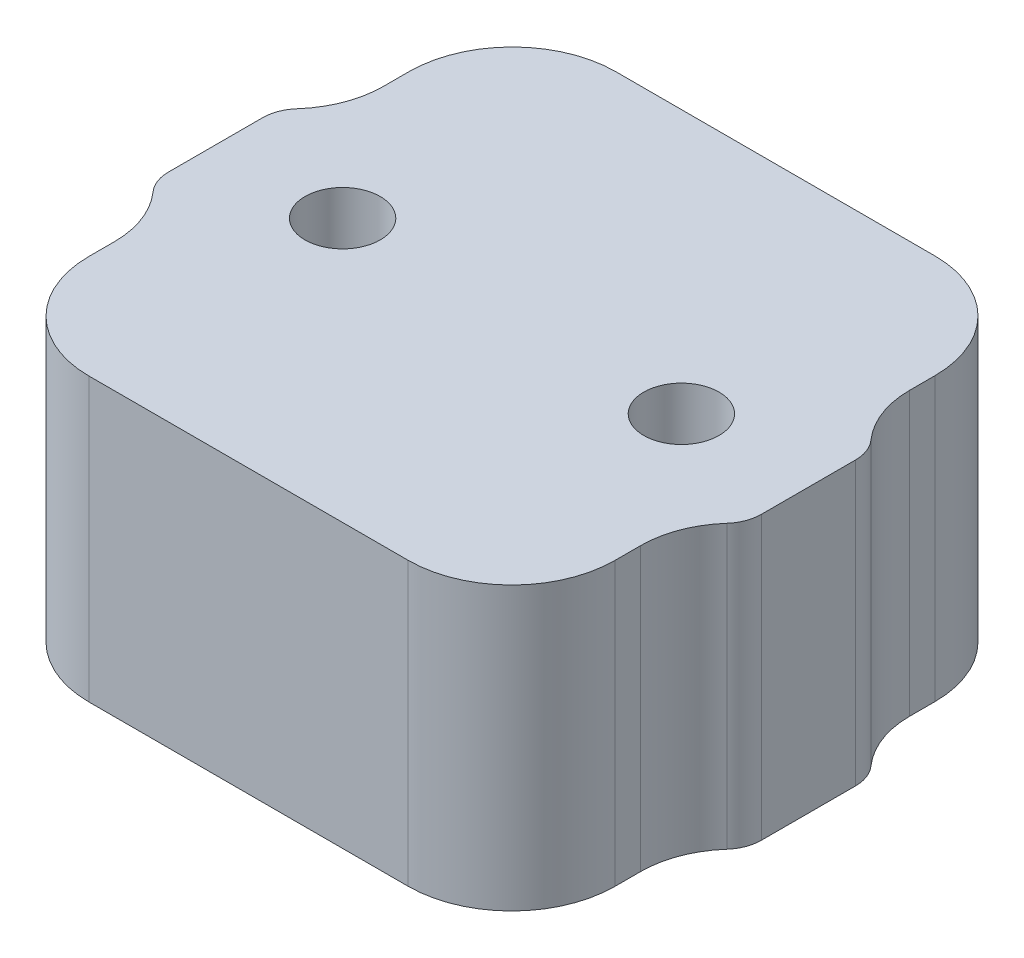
ISO-10303-21;
HEADER;
FILE_DESCRIPTION(('STEP AP214'),'2;1');
FILE_NAME('part.step','',(''),(''),'','','');
FILE_SCHEMA(('AUTOMOTIVE_DESIGN { 1 0 10303 214 1 1 1 1 }'));
ENDSEC;
DATA;
#1=APPLICATION_CONTEXT('core data for automotive mechanical design processes');
#2=APPLICATION_PROTOCOL_DEFINITION('international standard','automotive_design',2000,#1);
#3=PRODUCT_CONTEXT('',#1,'mechanical');
#4=PRODUCT('Part','Part','',(#3));
#5=PRODUCT_RELATED_PRODUCT_CATEGORY('part','',(#4));
#6=PRODUCT_DEFINITION_FORMATION('','',#4);
#7=PRODUCT_DEFINITION_CONTEXT('part definition',#1,'design');
#8=PRODUCT_DEFINITION('design','',#6,#7);
#9=PRODUCT_DEFINITION_SHAPE('','',#8);
#10=(LENGTH_UNIT() NAMED_UNIT(*) SI_UNIT(.MILLI.,.METRE.));
#11=(NAMED_UNIT(*) PLANE_ANGLE_UNIT() SI_UNIT($,.RADIAN.));
#12=(NAMED_UNIT(*) SI_UNIT($,.STERADIAN.) SOLID_ANGLE_UNIT());
#13=UNCERTAINTY_MEASURE_WITH_UNIT(LENGTH_MEASURE(1.E-05),#10,'distance_accuracy_value','');
#14=(GEOMETRIC_REPRESENTATION_CONTEXT(3) GLOBAL_UNCERTAINTY_ASSIGNED_CONTEXT((#13)) GLOBAL_UNIT_ASSIGNED_CONTEXT((#10,
#11,#12)) REPRESENTATION_CONTEXT('',''));
#15=CARTESIAN_POINT('',(0.,0.,0.));
#16=DIRECTION('',(0.,0.,1.));
#17=DIRECTION('',(1.,0.,0.));
#18=AXIS2_PLACEMENT_3D('',#15,#16,#17);
#19=CARTESIAN_POINT('',(-41.7259877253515,3.,-14.52639048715));
#20=DIRECTION('',(0.,-1.,0.));
#21=DIRECTION('',(0.,0.,-1.));
#22=AXIS2_PLACEMENT_3D('',#19,#20,#21);
#23=CYLINDRICAL_SURFACE('',#22,0.400000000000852);
#24=CARTESIAN_POINT('',(-41.7259877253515,0.,-14.52639048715));
#25=DIRECTION('',(0.,1.,0.));
#26=DIRECTION('',(0.,0.,1.));
#27=AXIS2_PLACEMENT_3D('',#24,#25,#26);
#28=CIRCLE('',#27,0.400000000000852);
#29=CARTESIAN_POINT('',(-42.0249214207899,0.,-14.7921698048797));
#30=VERTEX_POINT('',#29);
#31=CARTESIAN_POINT('',(-42.1259877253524,0.,-14.52639048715));
#32=VERTEX_POINT('',#31);
#33=EDGE_CURVE('E204',#30,#32,#28,.T.);
#34=ORIENTED_EDGE('',*,*,#33,.T.);
#35=DIRECTION('',(0.,-1.,0.));
#36=VECTOR('',#35,1.);
#37=CARTESIAN_POINT('',(-42.1259877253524,3.,-14.52639048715));
#38=LINE('',#37,#36);
#39=CARTESIAN_POINT('',(-42.1259877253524,3.,-14.52639048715));
#40=VERTEX_POINT('',#39);
#41=EDGE_CURVE('E11',#40,#32,#38,.T.);
#42=ORIENTED_EDGE('',*,*,#41,.F.);
#43=CARTESIAN_POINT('',(-41.7259877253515,3.,-14.52639048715));
#44=DIRECTION('',(0.,1.,0.));
#45=DIRECTION('',(0.,0.,1.));
#46=AXIS2_PLACEMENT_3D('',#43,#44,#45);
#47=CIRCLE('',#46,0.400000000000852);
#48=CARTESIAN_POINT('',(-42.0249214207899,3.,-14.7921698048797));
#49=VERTEX_POINT('',#48);
#50=EDGE_CURVE('E243',#49,#40,#47,.T.);
#51=ORIENTED_EDGE('',*,*,#50,.F.);
#52=DIRECTION('',(0.,-1.,0.));
#53=VECTOR('',#52,1.);
#54=CARTESIAN_POINT('',(-42.0249214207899,3.,-14.7921698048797));
#55=LINE('',#54,#53);
#56=EDGE_CURVE('E200',#49,#30,#55,.T.);
#57=ORIENTED_EDGE('',*,*,#56,.T.);
#58=EDGE_LOOP('',(#34,#42,#51,#57));
#59=FACE_BOUND('',#58,.T.);
#60=ADVANCED_FACE('F36',(#59),#23,.T.);
#61=CARTESIAN_POINT('',(-42.1259877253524,3.,-14.52639048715));
#62=DIRECTION('',(1.,0.,0.));
#63=DIRECTION('',(0.,0.,-1.));
#64=AXIS2_PLACEMENT_3D('',#61,#62,#63);
#65=PLANE('',#64);
#66=DIRECTION('',(0.,0.,1.));
#67=VECTOR('',#66,1.);
#68=CARTESIAN_POINT('',(-42.1259877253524,0.,-14.52639048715));
#69=LINE('',#68,#67);
#70=CARTESIAN_POINT('',(-42.1259877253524,0.,-13.52639048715));
#71=VERTEX_POINT('',#70);
#72=EDGE_CURVE('E207',#32,#71,#69,.T.);
#73=ORIENTED_EDGE('',*,*,#72,.T.);
#74=DIRECTION('',(0.,-1.,0.));
#75=VECTOR('',#74,1.);
#76=CARTESIAN_POINT('',(-42.1259877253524,3.,-13.52639048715));
#77=LINE('',#76,#75);
#78=CARTESIAN_POINT('',(-42.1259877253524,3.,-13.52639048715));
#79=VERTEX_POINT('',#78);
#80=EDGE_CURVE('E44',#79,#71,#77,.T.);
#81=ORIENTED_EDGE('',*,*,#80,.F.);
#82=DIRECTION('',(0.,0.,1.));
#83=VECTOR('',#82,1.);
#84=CARTESIAN_POINT('',(-42.1259877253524,3.,-14.52639048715));
#85=LINE('',#84,#83);
#86=EDGE_CURVE('E131',#40,#79,#85,.T.);
#87=ORIENTED_EDGE('',*,*,#86,.F.);
#88=ORIENTED_EDGE('',*,*,#41,.T.);
#89=EDGE_LOOP('',(#73,#81,#87,#88));
#90=FACE_BOUND('',#89,.T.);
#91=ADVANCED_FACE('F362',(#90),#65,.F.);
#92=CARTESIAN_POINT('',(-41.7259877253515,3.,-13.52639048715));
#93=DIRECTION('',(0.,-1.,0.));
#94=DIRECTION('',(0.,0.,-1.));
#95=AXIS2_PLACEMENT_3D('',#92,#93,#94);
#96=CYLINDRICAL_SURFACE('',#95,0.400000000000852);
#97=CARTESIAN_POINT('',(-41.7259877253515,0.,-13.52639048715));
#98=DIRECTION('',(0.,1.,0.));
#99=DIRECTION('',(0.,0.,-1.));
#100=AXIS2_PLACEMENT_3D('',#97,#98,#99);
#101=CIRCLE('',#100,0.400000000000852);
#102=CARTESIAN_POINT('',(-42.0249214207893,0.,-13.2606111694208));
#103=VERTEX_POINT('',#102);
#104=EDGE_CURVE('E210',#71,#103,#101,.T.);
#105=ORIENTED_EDGE('',*,*,#104,.T.);
#106=DIRECTION('',(0.,-1.,0.));
#107=VECTOR('',#106,1.);
#108=CARTESIAN_POINT('',(-42.0249214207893,3.,-13.2606111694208));
#109=LINE('',#108,#107);
#110=CARTESIAN_POINT('',(-42.0249214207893,3.,-13.2606111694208));
#111=VERTEX_POINT('',#110);
#112=EDGE_CURVE('E286',#111,#103,#109,.T.);
#113=ORIENTED_EDGE('',*,*,#112,.F.);
#114=CARTESIAN_POINT('',(-41.7259877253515,3.,-13.52639048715));
#115=DIRECTION('',(0.,1.,0.));
#116=DIRECTION('',(0.,0.,-1.));
#117=AXIS2_PLACEMENT_3D('',#114,#115,#116);
#118=CIRCLE('',#117,0.400000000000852);
#119=EDGE_CURVE('E294',#79,#111,#118,.T.);
#120=ORIENTED_EDGE('',*,*,#119,.F.);
#121=ORIENTED_EDGE('',*,*,#80,.T.);
#122=EDGE_LOOP('',(#105,#113,#120,#121));
#123=FACE_BOUND('',#122,.T.);
#124=ADVANCED_FACE('F292',(#123),#96,.T.);
#125=CARTESIAN_POINT('',(-42.7722556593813,3.,-12.5961628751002));
#126=DIRECTION('',(0.,-1.,0.));
#127=DIRECTION('',(0.,0.,-1.));
#128=AXIS2_PLACEMENT_3D('',#125,#126,#127);
#129=CYLINDRICAL_SURFACE('',#128,0.999999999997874);
#130=CARTESIAN_POINT('',(-42.7722556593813,0.,-12.5961628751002));
#131=DIRECTION('',(0.,-1.,0.));
#132=DIRECTION('',(0.,0.,1.));
#133=AXIS2_PLACEMENT_3D('',#130,#131,#132);
#134=CIRCLE('',#133,0.999999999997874);
#135=CARTESIAN_POINT('',(-41.7722556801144,0.,-12.5963664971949));
#136=VERTEX_POINT('',#135);
#137=EDGE_CURVE('E212',#103,#136,#134,.T.);
#138=ORIENTED_EDGE('',*,*,#137,.T.);
#139=DIRECTION('',(0.,-1.,0.));
#140=VECTOR('',#139,1.);
#141=CARTESIAN_POINT('',(-41.7722556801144,3.,-12.5963664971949));
#142=LINE('',#141,#140);
#143=CARTESIAN_POINT('',(-41.7722556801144,3.,-12.5963664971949));
#144=VERTEX_POINT('',#143);
#145=EDGE_CURVE('E283',#144,#136,#142,.T.);
#146=ORIENTED_EDGE('',*,*,#145,.F.);
#147=CARTESIAN_POINT('',(-42.7722556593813,3.,-12.5961628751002));
#148=DIRECTION('',(0.,-1.,0.));
#149=DIRECTION('',(0.,0.,1.));
#150=AXIS2_PLACEMENT_3D('',#147,#148,#149);
#151=CIRCLE('',#150,0.999999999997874);
#152=EDGE_CURVE('E312',#111,#144,#151,.T.);
#153=ORIENTED_EDGE('',*,*,#152,.F.);
#154=ORIENTED_EDGE('',*,*,#112,.T.);
#155=EDGE_LOOP('',(#138,#146,#153,#154));
#156=FACE_BOUND('',#155,.T.);
#157=ADVANCED_FACE('F303',(#156),#129,.F.);
#158=CARTESIAN_POINT('',(-41.7722006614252,3.,-12.326166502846));
#159=DIRECTION('',(0.999999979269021,0.,-0.000203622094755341));
#160=DIRECTION('',(-0.000203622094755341,0.,-0.999999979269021));
#161=AXIS2_PLACEMENT_3D('',#158,#159,#160);
#162=PLANE('',#161);
#163=DIRECTION('',(0.000203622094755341,0.,0.999999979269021));
#164=VECTOR('',#163,1.);
#165=CARTESIAN_POINT('',(-41.7722006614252,0.,-12.326166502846));
#166=LINE('',#165,#164);
#167=CARTESIAN_POINT('',(-41.7722006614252,0.,-12.326166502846));
#168=VERTEX_POINT('',#167);
#169=EDGE_CURVE('E214',#136,#168,#166,.T.);
#170=ORIENTED_EDGE('',*,*,#169,.T.);
#171=DIRECTION('',(0.,-1.,0.));
#172=VECTOR('',#171,1.);
#173=CARTESIAN_POINT('',(-41.7722006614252,3.,-12.326166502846));
#174=LINE('',#173,#172);
#175=CARTESIAN_POINT('',(-41.7722006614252,3.,-12.326166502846));
#176=VERTEX_POINT('',#175);
#177=EDGE_CURVE('E280',#176,#168,#174,.T.);
#178=ORIENTED_EDGE('',*,*,#177,.F.);
#179=DIRECTION('',(0.000203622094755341,0.,0.999999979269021));
#180=VECTOR('',#179,1.);
#181=CARTESIAN_POINT('',(-41.7722006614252,3.,-12.326166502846));
#182=LINE('',#181,#180);
#183=EDGE_CURVE('E309',#144,#176,#182,.T.);
#184=ORIENTED_EDGE('',*,*,#183,.F.);
#185=ORIENTED_EDGE('',*,*,#145,.T.);
#186=EDGE_LOOP('',(#170,#178,#184,#185));
#187=FACE_BOUND('',#186,.T.);
#188=ADVANCED_FACE('F307',(#187),#162,.F.);
#189=CARTESIAN_POINT('',(-40.6722006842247,3.,-12.3263904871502));
#190=DIRECTION('',(0.,-1.,0.));
#191=DIRECTION('',(0.,0.,-1.));
#192=AXIS2_PLACEMENT_3D('',#189,#190,#191);
#193=CYLINDRICAL_SURFACE('',#192,1.10000000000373);
#194=CARTESIAN_POINT('',(-40.6722006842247,0.,-12.3263904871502));
#195=DIRECTION('',(0.,1.,0.));
#196=DIRECTION('',(0.,0.,-1.));
#197=AXIS2_PLACEMENT_3D('',#194,#195,#196);
#198=CIRCLE('',#197,1.10000000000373);
#199=CARTESIAN_POINT('',(-40.6722006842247,0.,-11.2263904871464));
#200=VERTEX_POINT('',#199);
#201=EDGE_CURVE('E216',#168,#200,#198,.T.);
#202=ORIENTED_EDGE('',*,*,#201,.T.);
#203=DIRECTION('',(0.,-1.,0.));
#204=VECTOR('',#203,1.);
#205=CARTESIAN_POINT('',(-40.6722006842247,3.,-11.2263904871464));
#206=LINE('',#205,#204);
#207=CARTESIAN_POINT('',(-40.6722006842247,3.,-11.2263904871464));
#208=VERTEX_POINT('',#207);
#209=EDGE_CURVE('E277',#208,#200,#206,.T.);
#210=ORIENTED_EDGE('',*,*,#209,.F.);
#211=CARTESIAN_POINT('',(-40.6722006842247,3.,-12.3263904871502));
#212=DIRECTION('',(0.,1.,0.));
#213=DIRECTION('',(0.,0.,-1.));
#214=AXIS2_PLACEMENT_3D('',#211,#212,#213);
#215=CIRCLE('',#214,1.10000000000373);
#216=EDGE_CURVE('E311',#176,#208,#215,.T.);
#217=ORIENTED_EDGE('',*,*,#216,.F.);
#218=ORIENTED_EDGE('',*,*,#177,.T.);
#219=EDGE_LOOP('',(#202,#210,#217,#218));
#220=FACE_BOUND('',#219,.T.);
#221=ADVANCED_FACE('F375',(#220),#193,.T.);
#222=CARTESIAN_POINT('',(-37.2797747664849,3.,-11.2263904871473));
#223=DIRECTION('',(0.,0.,-1.));
#224=DIRECTION('',(-1.,0.,0.));
#225=AXIS2_PLACEMENT_3D('',#222,#223,#224);
#226=PLANE('',#225);
#227=DIRECTION('',(1.,0.,0.));
#228=VECTOR('',#227,1.);
#229=CARTESIAN_POINT('',(-37.2797747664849,0.,-11.2263904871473));
#230=LINE('',#229,#228);
#231=CARTESIAN_POINT('',(-37.2797747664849,0.,-11.2263904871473));
#232=VERTEX_POINT('',#231);
#233=EDGE_CURVE('E218',#200,#232,#230,.T.);
#234=ORIENTED_EDGE('',*,*,#233,.T.);
#235=DIRECTION('',(0.,-1.,0.));
#236=VECTOR('',#235,1.);
#237=CARTESIAN_POINT('',(-37.2797747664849,3.,-11.2263904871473));
#238=LINE('',#237,#236);
#239=CARTESIAN_POINT('',(-37.2797747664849,3.,-11.2263904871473));
#240=VERTEX_POINT('',#239);
#241=EDGE_CURVE('E274',#240,#232,#238,.T.);
#242=ORIENTED_EDGE('',*,*,#241,.F.);
#243=DIRECTION('',(1.,0.,0.));
#244=VECTOR('',#243,1.);
#245=CARTESIAN_POINT('',(-37.2797747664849,3.,-11.2263904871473));
#246=LINE('',#245,#244);
#247=EDGE_CURVE('E314',#208,#240,#246,.T.);
#248=ORIENTED_EDGE('',*,*,#247,.F.);
#249=ORIENTED_EDGE('',*,*,#209,.T.);
#250=EDGE_LOOP('',(#234,#242,#248,#249));
#251=FACE_BOUND('',#250,.T.);
#252=ADVANCED_FACE('F378',(#251),#226,.F.);
#253=CARTESIAN_POINT('',(-37.2797747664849,3.,-12.3263904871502));
#254=DIRECTION('',(0.,-1.,0.));
#255=DIRECTION('',(0.,0.,-1.));
#256=AXIS2_PLACEMENT_3D('',#253,#254,#255);
#257=CYLINDRICAL_SURFACE('',#256,1.10000000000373);
#258=CARTESIAN_POINT('',(-37.2797747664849,0.,-12.3263904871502));
#259=DIRECTION('',(0.,1.,0.));
#260=DIRECTION('',(0.,0.,1.));
#261=AXIS2_PLACEMENT_3D('',#258,#259,#260);
#262=CIRCLE('',#261,1.10000000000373);
#263=CARTESIAN_POINT('',(-36.1797747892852,0.,-12.326166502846));
#264=VERTEX_POINT('',#263);
#265=EDGE_CURVE('E220',#232,#264,#262,.T.);
#266=ORIENTED_EDGE('',*,*,#265,.T.);
#267=DIRECTION('',(0.,-1.,0.));
#268=VECTOR('',#267,1.);
#269=CARTESIAN_POINT('',(-36.1797747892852,3.,-12.326166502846));
#270=LINE('',#269,#268);
#271=CARTESIAN_POINT('',(-36.1797747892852,3.,-12.326166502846));
#272=VERTEX_POINT('',#271);
#273=EDGE_CURVE('E271',#272,#264,#270,.T.);
#274=ORIENTED_EDGE('',*,*,#273,.F.);
#275=CARTESIAN_POINT('',(-37.2797747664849,3.,-12.3263904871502));
#276=DIRECTION('',(0.,1.,0.));
#277=DIRECTION('',(0.,0.,1.));
#278=AXIS2_PLACEMENT_3D('',#275,#276,#277);
#279=CIRCLE('',#278,1.10000000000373);
#280=EDGE_CURVE('E320',#240,#272,#279,.T.);
#281=ORIENTED_EDGE('',*,*,#280,.F.);
#282=ORIENTED_EDGE('',*,*,#241,.T.);
#283=EDGE_LOOP('',(#266,#274,#281,#282));
#284=FACE_BOUND('',#283,.T.);
#285=ADVANCED_FACE('F382',(#284),#257,.T.);
#286=CARTESIAN_POINT('',(-36.1797747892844,3.,-12.326166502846));
#287=DIRECTION('',(-0.999999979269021,0.,-0.000203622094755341));
#288=DIRECTION('',(-0.000203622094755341,0.,0.999999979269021));
#289=AXIS2_PLACEMENT_3D('',#286,#287,#288);
#290=PLANE('',#289);
#291=DIRECTION('',(0.000203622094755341,0.,-0.999999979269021));
#292=VECTOR('',#291,1.);
#293=CARTESIAN_POINT('',(-36.1797747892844,0.,-12.326166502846));
#294=LINE('',#293,#292);
#295=CARTESIAN_POINT('',(-36.1797197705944,0.,-12.5963664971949));
#296=VERTEX_POINT('',#295);
#297=EDGE_CURVE('E222',#264,#296,#294,.T.);
#298=ORIENTED_EDGE('',*,*,#297,.T.);
#299=DIRECTION('',(0.,-1.,0.));
#300=VECTOR('',#299,1.);
#301=CARTESIAN_POINT('',(-36.1797197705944,3.,-12.5963664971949));
#302=LINE('',#301,#300);
#303=CARTESIAN_POINT('',(-36.1797197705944,3.,-12.5963664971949));
#304=VERTEX_POINT('',#303);
#305=EDGE_CURVE('E268',#304,#296,#302,.T.);
#306=ORIENTED_EDGE('',*,*,#305,.F.);
#307=DIRECTION('',(0.000203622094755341,0.,-0.999999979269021));
#308=VECTOR('',#307,1.);
#309=CARTESIAN_POINT('',(-36.1797747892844,3.,-12.326166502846));
#310=LINE('',#309,#308);
#311=EDGE_CURVE('E322',#272,#304,#310,.T.);
#312=ORIENTED_EDGE('',*,*,#311,.F.);
#313=ORIENTED_EDGE('',*,*,#273,.T.);
#314=EDGE_LOOP('',(#298,#306,#312,#313));
#315=FACE_BOUND('',#314,.T.);
#316=ADVANCED_FACE('F386',(#315),#290,.F.);
#317=CARTESIAN_POINT('',(-35.1797197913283,3.,-12.5961628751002));
#318=DIRECTION('',(0.,-1.,0.));
#319=DIRECTION('',(0.,0.,-1.));
#320=AXIS2_PLACEMENT_3D('',#317,#318,#319);
#321=CYLINDRICAL_SURFACE('',#320,0.999999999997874);
#322=CARTESIAN_POINT('',(-35.1797197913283,0.,-12.5961628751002));
#323=DIRECTION('',(0.,-1.,0.));
#324=DIRECTION('',(0.,0.,-1.));
#325=AXIS2_PLACEMENT_3D('',#322,#323,#324);
#326=CIRCLE('',#325,0.999999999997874);
#327=CARTESIAN_POINT('',(-35.9270540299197,0.,-13.2606111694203));
#328=VERTEX_POINT('',#327);
#329=EDGE_CURVE('E224',#296,#328,#326,.T.);
#330=ORIENTED_EDGE('',*,*,#329,.T.);
#331=DIRECTION('',(0.,-1.,0.));
#332=VECTOR('',#331,1.);
#333=CARTESIAN_POINT('',(-35.9270540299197,3.,-13.2606111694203));
#334=LINE('',#333,#332);
#335=CARTESIAN_POINT('',(-35.9270540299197,3.,-13.2606111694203));
#336=VERTEX_POINT('',#335);
#337=EDGE_CURVE('E265',#336,#328,#334,.T.);
#338=ORIENTED_EDGE('',*,*,#337,.F.);
#339=CARTESIAN_POINT('',(-35.1797197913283,3.,-12.5961628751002));
#340=DIRECTION('',(0.,-1.,0.));
#341=DIRECTION('',(0.,0.,-1.));
#342=AXIS2_PLACEMENT_3D('',#339,#340,#341);
#343=CIRCLE('',#342,0.999999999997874);
#344=EDGE_CURVE('E324',#304,#336,#343,.T.);
#345=ORIENTED_EDGE('',*,*,#344,.F.);
#346=ORIENTED_EDGE('',*,*,#305,.T.);
#347=EDGE_LOOP('',(#330,#338,#345,#346));
#348=FACE_BOUND('',#347,.T.);
#349=ADVANCED_FACE('F390',(#348),#321,.F.);
#350=CARTESIAN_POINT('',(-36.2259877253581,3.,-13.52639048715));
#351=DIRECTION('',(0.,-1.,0.));
#352=DIRECTION('',(0.,0.,-1.));
#353=AXIS2_PLACEMENT_3D('',#350,#351,#352);
#354=CYLINDRICAL_SURFACE('',#353,0.400000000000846);
#355=CARTESIAN_POINT('',(-36.2259877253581,0.,-13.52639048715));
#356=DIRECTION('',(0.,1.,0.));
#357=DIRECTION('',(0.,0.,1.));
#358=AXIS2_PLACEMENT_3D('',#355,#356,#357);
#359=CIRCLE('',#358,0.400000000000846);
#360=CARTESIAN_POINT('',(-35.8259877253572,0.,-13.52639048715));
#361=VERTEX_POINT('',#360);
#362=EDGE_CURVE('E226',#328,#361,#359,.T.);
#363=ORIENTED_EDGE('',*,*,#362,.T.);
#364=DIRECTION('',(0.,-1.,0.));
#365=VECTOR('',#364,1.);
#366=CARTESIAN_POINT('',(-35.8259877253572,3.,-13.52639048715));
#367=LINE('',#366,#365);
#368=CARTESIAN_POINT('',(-35.8259877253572,3.,-13.52639048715));
#369=VERTEX_POINT('',#368);
#370=EDGE_CURVE('E262',#369,#361,#367,.T.);
#371=ORIENTED_EDGE('',*,*,#370,.F.);
#372=CARTESIAN_POINT('',(-36.2259877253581,3.,-13.52639048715));
#373=DIRECTION('',(0.,1.,0.));
#374=DIRECTION('',(0.,0.,1.));
#375=AXIS2_PLACEMENT_3D('',#372,#373,#374);
#376=CIRCLE('',#375,0.400000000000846);
#377=EDGE_CURVE('E326',#336,#369,#376,.T.);
#378=ORIENTED_EDGE('',*,*,#377,.F.);
#379=ORIENTED_EDGE('',*,*,#337,.T.);
#380=EDGE_LOOP('',(#363,#371,#378,#379));
#381=FACE_BOUND('',#380,.T.);
#382=ADVANCED_FACE('F394',(#381),#354,.T.);
#383=CARTESIAN_POINT('',(-35.8259877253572,3.,-14.52639048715));
#384=DIRECTION('',(-1.,0.,0.));
#385=DIRECTION('',(0.,0.,1.));
#386=AXIS2_PLACEMENT_3D('',#383,#384,#385);
#387=PLANE('',#386);
#388=DIRECTION('',(0.,0.,-1.));
#389=VECTOR('',#388,1.);
#390=CARTESIAN_POINT('',(-35.8259877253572,0.,-14.52639048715));
#391=LINE('',#390,#389);
#392=CARTESIAN_POINT('',(-35.8259877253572,0.,-14.52639048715));
#393=VERTEX_POINT('',#392);
#394=EDGE_CURVE('E228',#361,#393,#391,.T.);
#395=ORIENTED_EDGE('',*,*,#394,.T.);
#396=DIRECTION('',(0.,-1.,0.));
#397=VECTOR('',#396,1.);
#398=CARTESIAN_POINT('',(-35.8259877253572,3.,-14.52639048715));
#399=LINE('',#398,#397);
#400=CARTESIAN_POINT('',(-35.8259877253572,3.,-14.52639048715));
#401=VERTEX_POINT('',#400);
#402=EDGE_CURVE('E259',#401,#393,#399,.T.);
#403=ORIENTED_EDGE('',*,*,#402,.F.);
#404=DIRECTION('',(0.,0.,-1.));
#405=VECTOR('',#404,1.);
#406=CARTESIAN_POINT('',(-35.8259877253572,3.,-14.52639048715));
#407=LINE('',#406,#405);
#408=EDGE_CURVE('E328',#369,#401,#407,.T.);
#409=ORIENTED_EDGE('',*,*,#408,.F.);
#410=ORIENTED_EDGE('',*,*,#370,.T.);
#411=EDGE_LOOP('',(#395,#403,#409,#410));
#412=FACE_BOUND('',#411,.T.);
#413=ADVANCED_FACE('F398',(#412),#387,.F.);
#414=CARTESIAN_POINT('',(-36.2259877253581,3.,-14.52639048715));
#415=DIRECTION('',(0.,-1.,0.));
#416=DIRECTION('',(0.,0.,-1.));
#417=AXIS2_PLACEMENT_3D('',#414,#415,#416);
#418=CYLINDRICAL_SURFACE('',#417,0.400000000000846);
#419=CARTESIAN_POINT('',(-36.2259877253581,0.,-14.52639048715));
#420=DIRECTION('',(0.,1.,0.));
#421=DIRECTION('',(0.,0.,-1.));
#422=AXIS2_PLACEMENT_3D('',#419,#420,#421);
#423=CIRCLE('',#422,0.400000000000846);
#424=CARTESIAN_POINT('',(-35.9270540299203,0.,-14.7921698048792));
#425=VERTEX_POINT('',#424);
#426=EDGE_CURVE('E230',#393,#425,#423,.T.);
#427=ORIENTED_EDGE('',*,*,#426,.T.);
#428=DIRECTION('',(0.,-1.,0.));
#429=VECTOR('',#428,1.);
#430=CARTESIAN_POINT('',(-35.9270540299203,3.,-14.7921698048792));
#431=LINE('',#430,#429);
#432=CARTESIAN_POINT('',(-35.9270540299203,3.,-14.7921698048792));
#433=VERTEX_POINT('',#432);
#434=EDGE_CURVE('E256',#433,#425,#431,.T.);
#435=ORIENTED_EDGE('',*,*,#434,.F.);
#436=CARTESIAN_POINT('',(-36.2259877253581,3.,-14.52639048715));
#437=DIRECTION('',(0.,1.,0.));
#438=DIRECTION('',(0.,0.,-1.));
#439=AXIS2_PLACEMENT_3D('',#436,#437,#438);
#440=CIRCLE('',#439,0.400000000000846);
#441=EDGE_CURVE('E330',#401,#433,#440,.T.);
#442=ORIENTED_EDGE('',*,*,#441,.F.);
#443=ORIENTED_EDGE('',*,*,#402,.T.);
#444=EDGE_LOOP('',(#427,#435,#442,#443));
#445=FACE_BOUND('',#444,.T.);
#446=ADVANCED_FACE('F402',(#445),#418,.T.);
#447=CARTESIAN_POINT('',(-35.1797197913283,3.,-15.4566180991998));
#448=DIRECTION('',(0.,-1.,0.));
#449=DIRECTION('',(0.,0.,-1.));
#450=AXIS2_PLACEMENT_3D('',#447,#448,#449);
#451=CYLINDRICAL_SURFACE('',#450,0.999999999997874);
#452=CARTESIAN_POINT('',(-35.1797197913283,0.,-15.4566180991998));
#453=DIRECTION('',(0.,-1.,0.));
#454=DIRECTION('',(0.,0.,1.));
#455=AXIS2_PLACEMENT_3D('',#452,#453,#454);
#456=CIRCLE('',#455,0.999999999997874);
#457=CARTESIAN_POINT('',(-36.1797197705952,0.,-15.4564144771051));
#458=VERTEX_POINT('',#457);
#459=EDGE_CURVE('E232',#425,#458,#456,.T.);
#460=ORIENTED_EDGE('',*,*,#459,.T.);
#461=DIRECTION('',(0.,-1.,0.));
#462=VECTOR('',#461,1.);
#463=CARTESIAN_POINT('',(-36.1797197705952,3.,-15.4564144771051));
#464=LINE('',#463,#462);
#465=CARTESIAN_POINT('',(-36.1797197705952,3.,-15.4564144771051));
#466=VERTEX_POINT('',#465);
#467=EDGE_CURVE('E253',#466,#458,#464,.T.);
#468=ORIENTED_EDGE('',*,*,#467,.F.);
#469=CARTESIAN_POINT('',(-35.1797197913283,3.,-15.4566180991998));
#470=DIRECTION('',(0.,-1.,0.));
#471=DIRECTION('',(0.,0.,1.));
#472=AXIS2_PLACEMENT_3D('',#469,#470,#471);
#473=CIRCLE('',#472,0.999999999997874);
#474=EDGE_CURVE('E332',#433,#466,#473,.T.);
#475=ORIENTED_EDGE('',*,*,#474,.F.);
#476=ORIENTED_EDGE('',*,*,#434,.T.);
#477=EDGE_LOOP('',(#460,#468,#475,#476));
#478=FACE_BOUND('',#477,.T.);
#479=ADVANCED_FACE('F406',(#478),#451,.F.);
#480=CARTESIAN_POINT('',(-36.1797747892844,3.,-15.726614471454));
#481=DIRECTION('',(-0.999999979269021,0.,0.000203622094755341));
#482=DIRECTION('',(0.000203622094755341,0.,0.999999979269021));
#483=AXIS2_PLACEMENT_3D('',#480,#481,#482);
#484=PLANE('',#483);
#485=DIRECTION('',(-0.000203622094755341,0.,-0.999999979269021));
#486=VECTOR('',#485,1.);
#487=CARTESIAN_POINT('',(-36.1797747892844,0.,-15.726614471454));
#488=LINE('',#487,#486);
#489=CARTESIAN_POINT('',(-36.1797747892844,0.,-15.726614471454));
#490=VERTEX_POINT('',#489);
#491=EDGE_CURVE('E234',#458,#490,#488,.T.);
#492=ORIENTED_EDGE('',*,*,#491,.T.);
#493=DIRECTION('',(0.,-1.,0.));
#494=VECTOR('',#493,1.);
#495=CARTESIAN_POINT('',(-36.1797747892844,3.,-15.726614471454));
#496=LINE('',#495,#494);
#497=CARTESIAN_POINT('',(-36.1797747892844,3.,-15.726614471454));
#498=VERTEX_POINT('',#497);
#499=EDGE_CURVE('E250',#498,#490,#496,.T.);
#500=ORIENTED_EDGE('',*,*,#499,.F.);
#501=DIRECTION('',(-0.000203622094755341,0.,-0.999999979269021));
#502=VECTOR('',#501,1.);
#503=CARTESIAN_POINT('',(-36.1797747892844,3.,-15.726614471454));
#504=LINE('',#503,#502);
#505=EDGE_CURVE('E334',#466,#498,#504,.T.);
#506=ORIENTED_EDGE('',*,*,#505,.F.);
#507=ORIENTED_EDGE('',*,*,#467,.T.);
#508=EDGE_LOOP('',(#492,#500,#506,#507));
#509=FACE_BOUND('',#508,.T.);
#510=ADVANCED_FACE('F410',(#509),#484,.F.);
#511=CARTESIAN_POINT('',(-37.2797747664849,3.,-15.7263904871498));
#512=DIRECTION('',(0.,-1.,0.));
#513=DIRECTION('',(0.,0.,-1.));
#514=AXIS2_PLACEMENT_3D('',#511,#512,#513);
#515=CYLINDRICAL_SURFACE('',#514,1.10000000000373);
#516=CARTESIAN_POINT('',(-37.2797747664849,0.,-15.7263904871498));
#517=DIRECTION('',(0.,1.,0.));
#518=DIRECTION('',(0.,0.,-1.));
#519=AXIS2_PLACEMENT_3D('',#516,#517,#518);
#520=CIRCLE('',#519,1.10000000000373);
#521=CARTESIAN_POINT('',(-37.2797747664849,0.,-16.8263904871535));
#522=VERTEX_POINT('',#521);
#523=EDGE_CURVE('E236',#490,#522,#520,.T.);
#524=ORIENTED_EDGE('',*,*,#523,.T.);
#525=DIRECTION('',(0.,-1.,0.));
#526=VECTOR('',#525,1.);
#527=CARTESIAN_POINT('',(-37.2797747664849,3.,-16.8263904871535));
#528=LINE('',#527,#526);
#529=CARTESIAN_POINT('',(-37.2797747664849,3.,-16.8263904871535));
#530=VERTEX_POINT('',#529);
#531=EDGE_CURVE('E247',#530,#522,#528,.T.);
#532=ORIENTED_EDGE('',*,*,#531,.F.);
#533=CARTESIAN_POINT('',(-37.2797747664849,3.,-15.7263904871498));
#534=DIRECTION('',(0.,1.,0.));
#535=DIRECTION('',(0.,0.,-1.));
#536=AXIS2_PLACEMENT_3D('',#533,#534,#535);
#537=CIRCLE('',#536,1.10000000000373);
#538=EDGE_CURVE('E336',#498,#530,#537,.T.);
#539=ORIENTED_EDGE('',*,*,#538,.F.);
#540=ORIENTED_EDGE('',*,*,#499,.T.);
#541=EDGE_LOOP('',(#524,#532,#539,#540));
#542=FACE_BOUND('',#541,.T.);
#543=ADVANCED_FACE('F342',(#542),#515,.T.);
#544=CARTESIAN_POINT('',(-37.2797747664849,3.,-16.8263904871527));
#545=DIRECTION('',(0.,0.,1.));
#546=DIRECTION('',(1.,0.,0.));
#547=AXIS2_PLACEMENT_3D('',#544,#545,#546);
#548=PLANE('',#547);
#549=DIRECTION('',(-1.,0.,0.));
#550=VECTOR('',#549,1.);
#551=CARTESIAN_POINT('',(-37.2797747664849,0.,-16.8263904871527));
#552=LINE('',#551,#550);
#553=CARTESIAN_POINT('',(-40.6722006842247,0.,-16.8263904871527));
#554=VERTEX_POINT('',#553);
#555=EDGE_CURVE('E238',#522,#554,#552,.T.);
#556=ORIENTED_EDGE('',*,*,#555,.T.);
#557=DIRECTION('',(0.,-1.,0.));
#558=VECTOR('',#557,1.);
#559=CARTESIAN_POINT('',(-40.6722006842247,3.,-16.8263904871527));
#560=LINE('',#559,#558);
#561=CARTESIAN_POINT('',(-40.6722006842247,3.,-16.8263904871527));
#562=VERTEX_POINT('',#561);
#563=EDGE_CURVE('E195',#562,#554,#560,.T.);
#564=ORIENTED_EDGE('',*,*,#563,.F.);
#565=DIRECTION('',(-1.,0.,0.));
#566=VECTOR('',#565,1.);
#567=CARTESIAN_POINT('',(-37.2797747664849,3.,-16.8263904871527));
#568=LINE('',#567,#566);
#569=EDGE_CURVE('E186',#530,#562,#568,.T.);
#570=ORIENTED_EDGE('',*,*,#569,.F.);
#571=ORIENTED_EDGE('',*,*,#531,.T.);
#572=EDGE_LOOP('',(#556,#564,#570,#571));
#573=FACE_BOUND('',#572,.T.);
#574=ADVANCED_FACE('F346',(#573),#548,.F.);
#575=CARTESIAN_POINT('',(-40.6722006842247,3.,-15.7263904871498));
#576=DIRECTION('',(0.,-1.,0.));
#577=DIRECTION('',(0.,0.,-1.));
#578=AXIS2_PLACEMENT_3D('',#575,#576,#577);
#579=CYLINDRICAL_SURFACE('',#578,1.10000000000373);
#580=CARTESIAN_POINT('',(-40.6722006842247,0.,-15.7263904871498));
#581=DIRECTION('',(0.,1.,0.));
#582=DIRECTION('',(0.,0.,1.));
#583=AXIS2_PLACEMENT_3D('',#580,#581,#582);
#584=CIRCLE('',#583,1.10000000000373);
#585=CARTESIAN_POINT('',(-41.7722006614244,0.,-15.726614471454));
#586=VERTEX_POINT('',#585);
#587=EDGE_CURVE('E194',#554,#586,#584,.T.);
#588=ORIENTED_EDGE('',*,*,#587,.T.);
#589=DIRECTION('',(0.,-1.,0.));
#590=VECTOR('',#589,1.);
#591=CARTESIAN_POINT('',(-41.7722006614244,3.,-15.726614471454));
#592=LINE('',#591,#590);
#593=CARTESIAN_POINT('',(-41.7722006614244,3.,-15.726614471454));
#594=VERTEX_POINT('',#593);
#595=EDGE_CURVE('E191',#594,#586,#592,.T.);
#596=ORIENTED_EDGE('',*,*,#595,.F.);
#597=CARTESIAN_POINT('',(-40.6722006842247,3.,-15.7263904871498));
#598=DIRECTION('',(0.,1.,0.));
#599=DIRECTION('',(0.,0.,1.));
#600=AXIS2_PLACEMENT_3D('',#597,#598,#599);
#601=CIRCLE('',#600,1.10000000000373);
#602=EDGE_CURVE('E180',#562,#594,#601,.T.);
#603=ORIENTED_EDGE('',*,*,#602,.F.);
#604=ORIENTED_EDGE('',*,*,#563,.T.);
#605=EDGE_LOOP('',(#588,#596,#603,#604));
#606=FACE_BOUND('',#605,.T.);
#607=ADVANCED_FACE('F192',(#606),#579,.T.);
#608=CARTESIAN_POINT('',(-41.7722006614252,3.,-15.726614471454));
#609=DIRECTION('',(0.999999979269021,0.,0.000203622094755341));
#610=DIRECTION('',(0.000203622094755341,0.,-0.999999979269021));
#611=AXIS2_PLACEMENT_3D('',#608,#609,#610);
#612=PLANE('',#611);
#613=DIRECTION('',(-0.000203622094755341,0.,0.999999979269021));
#614=VECTOR('',#613,1.);
#615=CARTESIAN_POINT('',(-41.7722006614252,0.,-15.726614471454));
#616=LINE('',#615,#614);
#617=CARTESIAN_POINT('',(-41.7722556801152,0.,-15.4564144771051));
#618=VERTEX_POINT('',#617);
#619=EDGE_CURVE('E117',#586,#618,#616,.T.);
#620=ORIENTED_EDGE('',*,*,#619,.T.);
#621=DIRECTION('',(0.,-1.,0.));
#622=VECTOR('',#621,1.);
#623=CARTESIAN_POINT('',(-41.7722556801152,3.,-15.4564144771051));
#624=LINE('',#623,#622);
#625=CARTESIAN_POINT('',(-41.7722556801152,3.,-15.4564144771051));
#626=VERTEX_POINT('',#625);
#627=EDGE_CURVE('E196',#626,#618,#624,.T.);
#628=ORIENTED_EDGE('',*,*,#627,.F.);
#629=DIRECTION('',(-0.000203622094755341,0.,0.999999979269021));
#630=VECTOR('',#629,1.);
#631=CARTESIAN_POINT('',(-41.7722006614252,3.,-15.726614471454));
#632=LINE('',#631,#630);
#633=EDGE_CURVE('E184',#594,#626,#632,.T.);
#634=ORIENTED_EDGE('',*,*,#633,.F.);
#635=ORIENTED_EDGE('',*,*,#595,.T.);
#636=EDGE_LOOP('',(#620,#628,#634,#635));
#637=FACE_BOUND('',#636,.T.);
#638=ADVANCED_FACE('F198',(#637),#612,.F.);
#639=CARTESIAN_POINT('',(-42.7722556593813,3.,-15.4566180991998));
#640=DIRECTION('',(0.,-1.,0.));
#641=DIRECTION('',(0.,0.,-1.));
#642=AXIS2_PLACEMENT_3D('',#639,#640,#641);
#643=CYLINDRICAL_SURFACE('',#642,0.999999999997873);
#644=CARTESIAN_POINT('',(-42.7722556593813,0.,-15.4566180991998));
#645=DIRECTION('',(0.,-1.,0.));
#646=DIRECTION('',(0.,0.,-1.));
#647=AXIS2_PLACEMENT_3D('',#644,#645,#646);
#648=CIRCLE('',#647,0.999999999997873);
#649=EDGE_CURVE('E123',#618,#30,#648,.T.);
#650=ORIENTED_EDGE('',*,*,#649,.T.);
#651=ORIENTED_EDGE('',*,*,#56,.F.);
#652=CARTESIAN_POINT('',(-42.7722556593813,3.,-15.4566180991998));
#653=DIRECTION('',(0.,-1.,0.));
#654=DIRECTION('',(0.,0.,-1.));
#655=AXIS2_PLACEMENT_3D('',#652,#653,#654);
#656=CIRCLE('',#655,0.999999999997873);
#657=EDGE_CURVE('E52',#626,#49,#656,.T.);
#658=ORIENTED_EDGE('',*,*,#657,.F.);
#659=ORIENTED_EDGE('',*,*,#627,.T.);
#660=EDGE_LOOP('',(#650,#651,#658,#659));
#661=FACE_BOUND('',#660,.T.);
#662=ADVANCED_FACE('F350',(#661),#643,.F.);
#663=CARTESIAN_POINT('',(-41.7259877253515,3.,-14.52639048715));
#664=DIRECTION('',(0.,1.,0.));
#665=DIRECTION('',(0.,0.,1.));
#666=AXIS2_PLACEMENT_3D('',#663,#664,#665);
#667=PLANE('',#666);
#668=CARTESIAN_POINT('',(-40.7759877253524,3.,-14.02639048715));
#669=DIRECTION('',(0.,1.,0.));
#670=DIRECTION('',(0.,0.,1.));
#671=AXIS2_PLACEMENT_3D('',#668,#669,#670);
#672=CIRCLE('',#671,0.399999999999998);
#673=CARTESIAN_POINT('',(-40.7759877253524,3.,-13.62639048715));
#674=VERTEX_POINT('',#673);
#675=EDGE_CURVE('E621',#674,#674,#672,.T.);
#676=ORIENTED_EDGE('',*,*,#675,.F.);
#677=EDGE_LOOP('',(#676));
#678=FACE_BOUND('',#677,.T.);
#679=CARTESIAN_POINT('',(-37.1759877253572,3.,-14.02639048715));
#680=DIRECTION('',(0.,1.,0.));
#681=DIRECTION('',(0.,0.,-1.));
#682=AXIS2_PLACEMENT_3D('',#679,#680,#681);
#683=CIRCLE('',#682,0.399999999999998);
#684=CARTESIAN_POINT('',(-37.1759877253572,3.,-14.42639048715));
#685=VERTEX_POINT('',#684);
#686=EDGE_CURVE('E622',#685,#685,#683,.T.);
#687=ORIENTED_EDGE('',*,*,#686,.F.);
#688=EDGE_LOOP('',(#687));
#689=FACE_BOUND('',#688,.T.);
#690=ORIENTED_EDGE('',*,*,#50,.T.);
#691=ORIENTED_EDGE('',*,*,#86,.T.);
#692=ORIENTED_EDGE('',*,*,#119,.T.);
#693=ORIENTED_EDGE('',*,*,#152,.T.);
#694=ORIENTED_EDGE('',*,*,#183,.T.);
#695=ORIENTED_EDGE('',*,*,#216,.T.);
#696=ORIENTED_EDGE('',*,*,#247,.T.);
#697=ORIENTED_EDGE('',*,*,#280,.T.);
#698=ORIENTED_EDGE('',*,*,#311,.T.);
#699=ORIENTED_EDGE('',*,*,#344,.T.);
#700=ORIENTED_EDGE('',*,*,#377,.T.);
#701=ORIENTED_EDGE('',*,*,#408,.T.);
#702=ORIENTED_EDGE('',*,*,#441,.T.);
#703=ORIENTED_EDGE('',*,*,#474,.T.);
#704=ORIENTED_EDGE('',*,*,#505,.T.);
#705=ORIENTED_EDGE('',*,*,#538,.T.);
#706=ORIENTED_EDGE('',*,*,#569,.T.);
#707=ORIENTED_EDGE('',*,*,#602,.T.);
#708=ORIENTED_EDGE('',*,*,#633,.T.);
#709=ORIENTED_EDGE('',*,*,#657,.T.);
#710=EDGE_LOOP('',(#690,#691,#692,#693,#694,#695,#696,#697,#698,#699,#700,#701,#702,#703,#704,
#705,#706,#707,#708,#709));
#711=FACE_BOUND('',#710,.T.);
#712=ADVANCED_FACE('F182',(#678,#689,#711),#667,.T.);
#713=CARTESIAN_POINT('',(-41.7259877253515,0.,-14.52639048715));
#714=DIRECTION('',(0.,1.,0.));
#715=DIRECTION('',(0.,0.,1.));
#716=AXIS2_PLACEMENT_3D('',#713,#714,#715);
#717=PLANE('',#716);
#718=CARTESIAN_POINT('',(-40.7759877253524,0.,-14.02639048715));
#719=DIRECTION('',(0.,1.,0.));
#720=DIRECTION('',(0.,0.,1.));
#721=AXIS2_PLACEMENT_3D('',#718,#719,#720);
#722=CIRCLE('',#721,0.399999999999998);
#723=CARTESIAN_POINT('',(-40.7759877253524,0.,-13.62639048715));
#724=VERTEX_POINT('',#723);
#725=EDGE_CURVE('E208',#724,#724,#722,.T.);
#726=ORIENTED_EDGE('',*,*,#725,.T.);
#727=EDGE_LOOP('',(#726));
#728=FACE_BOUND('',#727,.T.);
#729=CARTESIAN_POINT('',(-37.1759877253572,0.,-14.02639048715));
#730=DIRECTION('',(0.,1.,0.));
#731=DIRECTION('',(0.,0.,-1.));
#732=AXIS2_PLACEMENT_3D('',#729,#730,#731);
#733=CIRCLE('',#732,0.399999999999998);
#734=CARTESIAN_POINT('',(-37.1759877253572,0.,-14.42639048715));
#735=VERTEX_POINT('',#734);
#736=EDGE_CURVE('E626',#735,#735,#733,.T.);
#737=ORIENTED_EDGE('',*,*,#736,.T.);
#738=EDGE_LOOP('',(#737));
#739=FACE_BOUND('',#738,.T.);
#740=ORIENTED_EDGE('',*,*,#33,.F.);
#741=ORIENTED_EDGE('',*,*,#649,.F.);
#742=ORIENTED_EDGE('',*,*,#619,.F.);
#743=ORIENTED_EDGE('',*,*,#587,.F.);
#744=ORIENTED_EDGE('',*,*,#555,.F.);
#745=ORIENTED_EDGE('',*,*,#523,.F.);
#746=ORIENTED_EDGE('',*,*,#491,.F.);
#747=ORIENTED_EDGE('',*,*,#459,.F.);
#748=ORIENTED_EDGE('',*,*,#426,.F.);
#749=ORIENTED_EDGE('',*,*,#394,.F.);
#750=ORIENTED_EDGE('',*,*,#362,.F.);
#751=ORIENTED_EDGE('',*,*,#329,.F.);
#752=ORIENTED_EDGE('',*,*,#297,.F.);
#753=ORIENTED_EDGE('',*,*,#265,.F.);
#754=ORIENTED_EDGE('',*,*,#233,.F.);
#755=ORIENTED_EDGE('',*,*,#201,.F.);
#756=ORIENTED_EDGE('',*,*,#169,.F.);
#757=ORIENTED_EDGE('',*,*,#137,.F.);
#758=ORIENTED_EDGE('',*,*,#104,.F.);
#759=ORIENTED_EDGE('',*,*,#72,.F.);
#760=EDGE_LOOP('',(#740,#741,#742,#743,#744,#745,#746,#747,#748,#749,#750,#751,#752,#753,#754,
#755,#756,#757,#758,#759));
#761=FACE_BOUND('',#760,.T.);
#762=ADVANCED_FACE('F298',(#728,#739,#761),#717,.F.);
#763=CARTESIAN_POINT('',(-37.1759877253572,0.,-14.02639048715));
#764=DIRECTION('',(0.,1.,0.));
#765=DIRECTION('',(0.,0.,1.));
#766=AXIS2_PLACEMENT_3D('',#763,#764,#765);
#767=CYLINDRICAL_SURFACE('',#766,0.399999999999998);
#768=ORIENTED_EDGE('',*,*,#736,.F.);
#769=EDGE_LOOP('',(#768));
#770=FACE_BOUND('',#769,.T.);
#771=ORIENTED_EDGE('',*,*,#686,.T.);
#772=EDGE_LOOP('',(#771));
#773=FACE_BOUND('',#772,.T.);
#774=ADVANCED_FACE('F450',(#770,#773),#767,.F.);
#775=CARTESIAN_POINT('',(-40.7759877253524,0.,-14.02639048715));
#776=DIRECTION('',(0.,1.,0.));
#777=DIRECTION('',(0.,0.,1.));
#778=AXIS2_PLACEMENT_3D('',#775,#776,#777);
#779=CYLINDRICAL_SURFACE('',#778,0.399999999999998);
#780=ORIENTED_EDGE('',*,*,#725,.F.);
#781=EDGE_LOOP('',(#780));
#782=FACE_BOUND('',#781,.T.);
#783=ORIENTED_EDGE('',*,*,#675,.T.);
#784=EDGE_LOOP('',(#783));
#785=FACE_BOUND('',#784,.T.);
#786=ADVANCED_FACE('F460',(#782,#785),#779,.F.);
#787=CLOSED_SHELL('',(#60,#91,#124,#157,#188,#221,#252,#285,#316,#349,#382,#413,#446,#479,#510,
#543,#574,#607,#638,#662,#712,#762,#774,#786));
#788=MANIFOLD_SOLID_BREP('B2',#787);
#789=ADVANCED_BREP_SHAPE_REPRESENTATION('',(#18,#788),#14);
#790=SHAPE_DEFINITION_REPRESENTATION(#9,#789);
ENDSEC;
END-ISO-10303-21;
